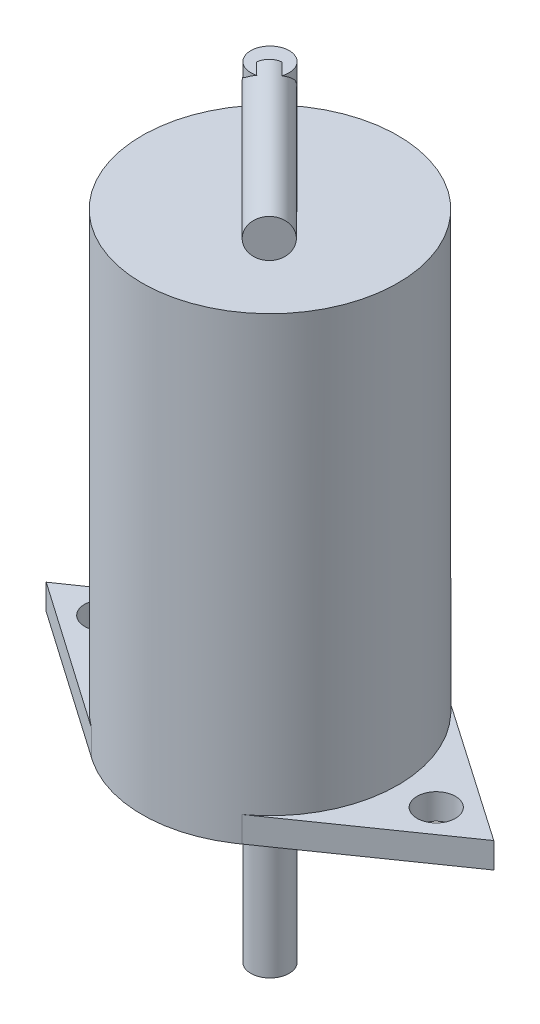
from build123d import *

# Parameters (mm, degrees)
SKETCH_1_R          = 10
EXTRUDE_1_DEPTH     = 36
EXTRUDE_2_DEPTH     = 2
EXTRUDE_3_DEPTH     = 2
SKETCH_6_R          = 1.5
CUT_EXTRUDE_1_DEPTH = 2
SKETCH_7_R          = 1.5
EXTRUDE_4_DEPTH     = 15
SKETCH_10_R         = 1.5
EXTRUDE_5_DEPTH     = 15
EXTRUDE_START       = 10
SKETCH_11_R         = 1.5
EXTRUDE_6_DEPTH     = 10
SKETCH_13_R         = 1.5
EXTRUDE_7_DEPTH     = 23
SKETCH_14_R         = 1.5
EXTRUDE_8_DEPTH     = 15


with BuildPart() as part:
    # Sketch 1 → Extrude 1 (new body)
    with BuildSketch(Plane(origin=(0, 0, 0), x_dir=(1, 0, 0), z_dir=(0, 1, 0))):
        with Locations(Location((0, 0, 0), (0, 0, 270))):
            Circle(SKETCH_1_R)
    extrude(amount=EXTRUDE_1_DEPTH)

    # Sketch 2 → Extrude 2 (add)
    with BuildSketch(Plane.XZ):
        Polygon((-14.5, 0), (-6.767871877, 7.361787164), (6.767871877, 7.361787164), (14.5, 0), (6.767871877, -7.361787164), (-6.767871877, -7.361787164), align=None)
    extrude(amount=-EXTRUDE_2_DEPTH)

    # Sketch 5 → Extrude 3 (add)
    with BuildSketch(Plane.XZ):
        Polygon((-17.5, 0), (-5.532728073, 8.330001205), (5.532728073, 8.330001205), (17.5, 0), (4.891653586, -8.721910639), (-4.891653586, -8.721910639), align=None)
    extrude(amount=-EXTRUDE_3_DEPTH)

    # Sketch 6 → Cut-Extrude 1 (cut)
    with BuildSketch(Plane.XZ):
        with Locations(Location((-13, 0, 0), (0, 0, 270))):
            Circle(SKETCH_6_R)
        with Locations(Location((13, 0, 0), (0, 0, 270))):
            Circle(SKETCH_6_R)
    extrude(amount=-CUT_EXTRUDE_1_DEPTH, mode=Mode.SUBTRACT)

    # Sketch 7 → Extrude 4 (add)
    with BuildSketch(Plane.XZ):
        with Locations(Location((0, 0, 0), (0, 0, 90))):
            Circle(SKETCH_7_R)
    extrude(amount=EXTRUDE_4_DEPTH)

    # Sketch 10 → Extrude 5 (add)
    with BuildSketch(Plane(origin=(-0.047453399, 0.000125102, -0.047453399), x_dir=(-0.7071030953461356, 0.0018641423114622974, 0.7071080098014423), z_dir=(-0.7071055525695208, 0.0018641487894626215, -0.7071055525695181))):
        with Locations(Location((0.108220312, 9.980861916, 0), (0, 0, 179.893192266))):
            Circle(SKETCH_10_R)
    extrude(amount=EXTRUDE_5_DEPTH)

    # Sketch 11 → Extrude 6 (add)
    with BuildSketch(Plane(origin=(0, 36, 0), x_dir=(1, 0, 0), z_dir=(0, 1, 0)).offset(EXTRUDE_START)):
        with Locations(Location((0, 0, 0), (0, 0, 270))):
            Circle(SKETCH_11_R)
    extrude(amount=-EXTRUDE_6_DEPTH)

    # Sketch 13 → Extrude 7 (add)
    with BuildSketch(Plane(origin=(-0.047453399, 0.000125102, -0.047453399), x_dir=(-0.7071030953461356, 0.0018641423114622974, 0.7071080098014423), z_dir=(-0.7071055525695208, 0.0018641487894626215, -0.7071055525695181))):
        with Locations(Location((0.108220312, 9.980861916, 0), (0, 0, 179.893192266))):
            Circle(SKETCH_13_R)
    extrude(amount=EXTRUDE_7_DEPTH)

    # Sketch 14 → Extrude 8 (add)
    with BuildSketch(Plane(origin=(-0.047453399, 0.000125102, -0.047453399), x_dir=(-0.7071030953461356, 0.0018641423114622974, 0.7071080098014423), z_dir=(-0.7071055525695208, 0.0018641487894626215, -0.7071055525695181))):
        with Locations(Location((0.124574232, 44.670975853, 0), (0, 0, 359.893192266))):
            Circle(SKETCH_14_R)
    extrude(amount=-EXTRUDE_8_DEPTH)


solid = part.part
